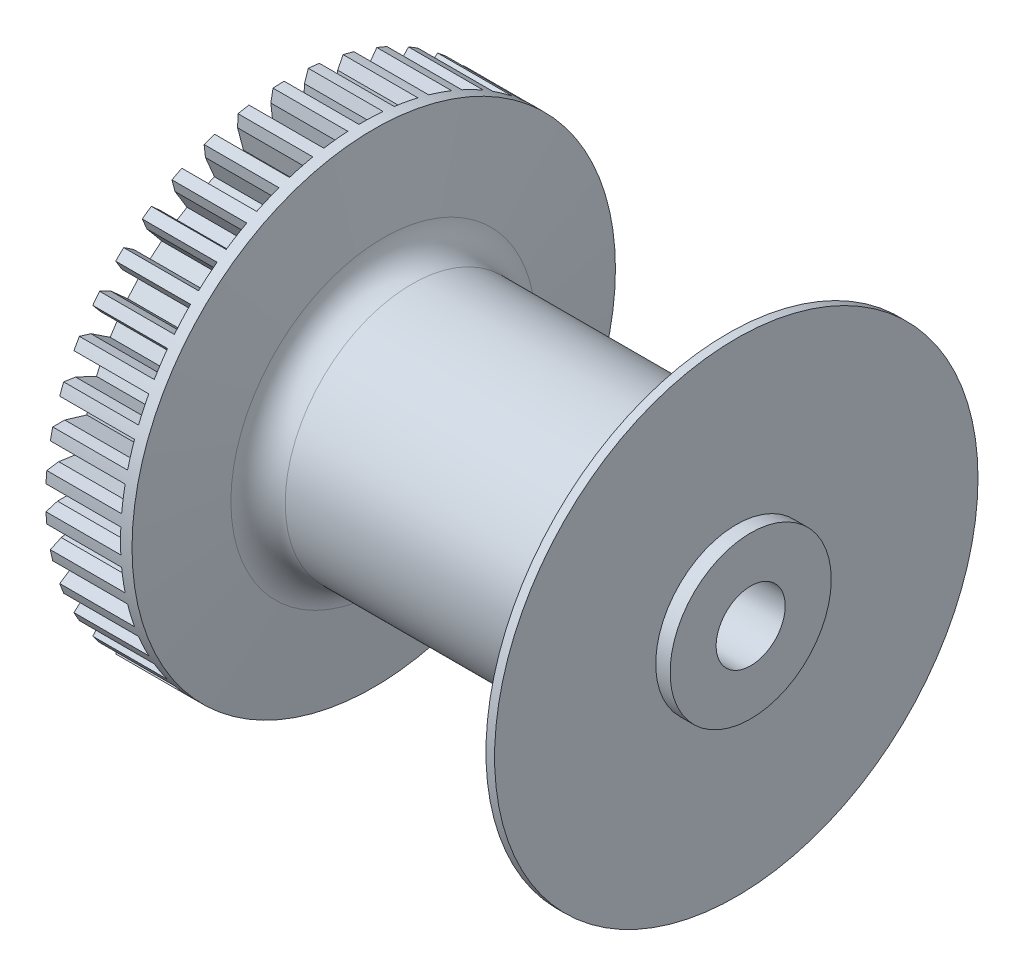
from build123d import *

# Parameters (mm, degrees)
ENL_V_MAT_EXTRU_1_DEPTH         = 13
R_P_TITION_CIRCULAIRE1_COUNT    = 43
ESQUISSE44_R                    = 14
BOSS_EXTRU_1_DEPTH              = 2.5
DIAM_TRE_DU_PER_AGE_12_0_12_1_D = 12
CONG_1_R                        = 5


with BuildPart() as part:
    # Esquisse1 → R_volution1 (revolve)
    with BuildSketch(Plane.XY, mode=Mode.PRIVATE) as r_volution1_sk:
        Polygon((-41, 42), (-41, 0), (37, 0), (37, 42), (35.5, 42), (32.253905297, 22), (-23.873207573, 22), (-26, 42), align=None)
    revolve(r_volution1_sk.sketch.rotate(Axis((-41, 0, 0), (1, 0, 0)), 270), axis=Axis((-41, 0, 0), (1, 0, 0)))

    # Esquisse2 → Enl_v. mat.-Extru.1 (cut)
    with BuildSketch(Plane.ZY.offset(41)):
        with BuildLine():
            Line((39.947467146, 1.5), (35.947467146, 1.5))
            Line((35.947467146, 1.5), (35.947467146, -1.5))
            Line((35.947467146, -1.5), (39.947467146, -1.5))
            Line((39.947467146, -1.5), (41.947467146, -2.1))
            ThreePointArc((41.947467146, -2.1), (42, 0), (41.947467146, 2.1))
            Line((41.947467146, 2.1), (39.947467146, 1.5))
        make_face()
    enl_v_mat_extru_1 = extrude(amount=-ENL_V_MAT_EXTRU_1_DEPTH, mode=Mode.SUBTRACT)

    # R_p_tition circulaire1: Enl_v. mat.-Extru.1 ×43 about axis
    r_p_tition_circulaire1_axis = Axis((0, 0, 0), (1, 0, 0))
    for i in range(1, R_P_TITION_CIRCULAIRE1_COUNT):
        add(enl_v_mat_extru_1.rotate(r_p_tition_circulaire1_axis, i * 360 / R_P_TITION_CIRCULAIRE1_COUNT), mode=Mode.SUBTRACT)

    # Esquisse44 → Boss.-Extru.1 (add)
    with BuildSketch(Plane(origin=(37, 0, 0), x_dir=(0, 0, -1), z_dir=(1, 0, 0))):
        Circle(ESQUISSE44_R)
    extrude(amount=BOSS_EXTRU_1_DEPTH)

    # Diam_tre du per_age _12.0 _12_1 (through all)
    with Locations(Plane(origin=(39.5, 0, 0), x_dir=(0, 0, -1), z_dir=(1, 0, 0))):
        with Locations((0, 0)):
            Hole(DIAM_TRE_DU_PER_AGE_12_0_12_1_D / 2)

    # Cong_1
    cong_1_edges = [part.edges().sort_by_distance(p)[0] for p in [
        (-23.873207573, 0, 22),
        (32.253905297, 0, 22),
    ]]
    fillet(cong_1_edges, radius=CONG_1_R)


solid = part.part
